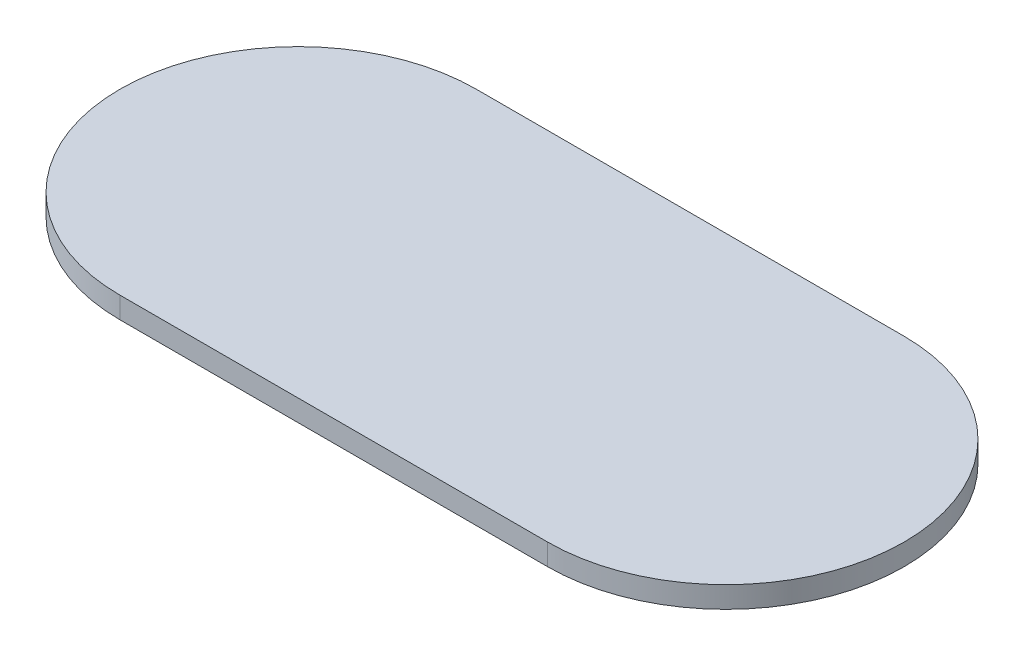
ISO-10303-21;
HEADER;
FILE_DESCRIPTION(('STEP AP214'),'2;1');
FILE_NAME('part.step','',(''),(''),'','','');
FILE_SCHEMA(('AUTOMOTIVE_DESIGN { 1 0 10303 214 1 1 1 1 }'));
ENDSEC;
DATA;
#1=APPLICATION_CONTEXT('core data for automotive mechanical design processes');
#2=APPLICATION_PROTOCOL_DEFINITION('international standard','automotive_design',2000,#1);
#3=PRODUCT_CONTEXT('',#1,'mechanical');
#4=PRODUCT('Part','Part','',(#3));
#5=PRODUCT_RELATED_PRODUCT_CATEGORY('part','',(#4));
#6=PRODUCT_DEFINITION_FORMATION('','',#4);
#7=PRODUCT_DEFINITION_CONTEXT('part definition',#1,'design');
#8=PRODUCT_DEFINITION('design','',#6,#7);
#9=PRODUCT_DEFINITION_SHAPE('','',#8);
#10=(LENGTH_UNIT() NAMED_UNIT(*) SI_UNIT(.MILLI.,.METRE.));
#11=(NAMED_UNIT(*) PLANE_ANGLE_UNIT() SI_UNIT($,.RADIAN.));
#12=(NAMED_UNIT(*) SI_UNIT($,.STERADIAN.) SOLID_ANGLE_UNIT());
#13=UNCERTAINTY_MEASURE_WITH_UNIT(LENGTH_MEASURE(1.E-05),#10,'distance_accuracy_value','');
#14=(GEOMETRIC_REPRESENTATION_CONTEXT(3) GLOBAL_UNCERTAINTY_ASSIGNED_CONTEXT((#13)) GLOBAL_UNIT_ASSIGNED_CONTEXT((#10,
#11,#12)) REPRESENTATION_CONTEXT('',''));
#15=CARTESIAN_POINT('',(0.,0.,0.));
#16=DIRECTION('',(0.,0.,1.));
#17=DIRECTION('',(1.,0.,0.));
#18=AXIS2_PLACEMENT_3D('',#15,#16,#17);
#19=CARTESIAN_POINT('',(-150.,7.5,0.));
#20=DIRECTION('',(0.,-1.,0.));
#21=DIRECTION('',(0.,0.,-1.));
#22=AXIS2_PLACEMENT_3D('',#19,#20,#21);
#23=CYLINDRICAL_SURFACE('',#22,125.);
#24=CARTESIAN_POINT('',(-150.,-7.5,0.));
#25=DIRECTION('',(0.,1.,0.));
#26=DIRECTION('',(0.,0.,1.));
#27=AXIS2_PLACEMENT_3D('',#24,#25,#26);
#28=CIRCLE('',#27,125.);
#29=CARTESIAN_POINT('',(-150.,-7.5,-125.));
#30=VERTEX_POINT('',#29);
#31=CARTESIAN_POINT('',(-150.,-7.5,125.));
#32=VERTEX_POINT('',#31);
#33=EDGE_CURVE('E97',#30,#32,#28,.T.);
#34=ORIENTED_EDGE('',*,*,#33,.T.);
#35=DIRECTION('',(0.,-1.,0.));
#36=VECTOR('',#35,1.);
#37=CARTESIAN_POINT('',(-150.,7.5,125.));
#38=LINE('',#37,#36);
#39=CARTESIAN_POINT('',(-150.,7.5,125.));
#40=VERTEX_POINT('',#39);
#41=EDGE_CURVE('E11',#40,#32,#38,.T.);
#42=ORIENTED_EDGE('',*,*,#41,.F.);
#43=CARTESIAN_POINT('',(-150.,7.5,0.));
#44=DIRECTION('',(0.,1.,0.));
#45=DIRECTION('',(0.,0.,1.));
#46=AXIS2_PLACEMENT_3D('',#43,#44,#45);
#47=CIRCLE('',#46,125.);
#48=CARTESIAN_POINT('',(-150.,7.5,-125.));
#49=VERTEX_POINT('',#48);
#50=EDGE_CURVE('E85',#49,#40,#47,.T.);
#51=ORIENTED_EDGE('',*,*,#50,.F.);
#52=DIRECTION('',(0.,-1.,0.));
#53=VECTOR('',#52,1.);
#54=CARTESIAN_POINT('',(-150.,7.5,-125.));
#55=LINE('',#54,#53);
#56=EDGE_CURVE('E93',#49,#30,#55,.T.);
#57=ORIENTED_EDGE('',*,*,#56,.T.);
#58=EDGE_LOOP('',(#34,#42,#51,#57));
#59=FACE_BOUND('',#58,.T.);
#60=ADVANCED_FACE('F34',(#59),#23,.T.);
#61=CARTESIAN_POINT('',(-150.,7.5,125.));
#62=DIRECTION('',(0.,0.,-1.));
#63=DIRECTION('',(-1.,0.,0.));
#64=AXIS2_PLACEMENT_3D('',#61,#62,#63);
#65=PLANE('',#64);
#66=DIRECTION('',(1.,0.,0.));
#67=VECTOR('',#66,1.);
#68=CARTESIAN_POINT('',(-150.,-7.5,125.));
#69=LINE('',#68,#67);
#70=CARTESIAN_POINT('',(150.,-7.5,125.));
#71=VERTEX_POINT('',#70);
#72=EDGE_CURVE('E89',#32,#71,#69,.T.);
#73=ORIENTED_EDGE('',*,*,#72,.T.);
#74=DIRECTION('',(0.,-1.,0.));
#75=VECTOR('',#74,1.);
#76=CARTESIAN_POINT('',(150.,7.5,125.));
#77=LINE('',#76,#75);
#78=CARTESIAN_POINT('',(150.,7.5,125.));
#79=VERTEX_POINT('',#78);
#80=EDGE_CURVE('E42',#79,#71,#77,.T.);
#81=ORIENTED_EDGE('',*,*,#80,.F.);
#82=DIRECTION('',(1.,0.,0.));
#83=VECTOR('',#82,1.);
#84=CARTESIAN_POINT('',(-150.,7.5,125.));
#85=LINE('',#84,#83);
#86=EDGE_CURVE('E80',#40,#79,#85,.T.);
#87=ORIENTED_EDGE('',*,*,#86,.F.);
#88=ORIENTED_EDGE('',*,*,#41,.T.);
#89=EDGE_LOOP('',(#73,#81,#87,#88));
#90=FACE_BOUND('',#89,.T.);
#91=ADVANCED_FACE('F88',(#90),#65,.F.);
#92=CARTESIAN_POINT('',(150.,7.5,0.));
#93=DIRECTION('',(0.,-1.,0.));
#94=DIRECTION('',(0.,0.,-1.));
#95=AXIS2_PLACEMENT_3D('',#92,#93,#94);
#96=CYLINDRICAL_SURFACE('',#95,125.);
#97=CARTESIAN_POINT('',(150.,-7.5,0.));
#98=DIRECTION('',(0.,1.,0.));
#99=DIRECTION('',(0.,0.,1.));
#100=AXIS2_PLACEMENT_3D('',#97,#98,#99);
#101=CIRCLE('',#100,125.);
#102=CARTESIAN_POINT('',(150.,-7.5,-125.));
#103=VERTEX_POINT('',#102);
#104=EDGE_CURVE('E67',#71,#103,#101,.T.);
#105=ORIENTED_EDGE('',*,*,#104,.T.);
#106=DIRECTION('',(0.,-1.,0.));
#107=VECTOR('',#106,1.);
#108=CARTESIAN_POINT('',(150.,7.5,-125.));
#109=LINE('',#108,#107);
#110=CARTESIAN_POINT('',(150.,7.5,-125.));
#111=VERTEX_POINT('',#110);
#112=EDGE_CURVE('E90',#111,#103,#109,.T.);
#113=ORIENTED_EDGE('',*,*,#112,.F.);
#114=CARTESIAN_POINT('',(150.,7.5,0.));
#115=DIRECTION('',(0.,1.,0.));
#116=DIRECTION('',(0.,0.,1.));
#117=AXIS2_PLACEMENT_3D('',#114,#115,#116);
#118=CIRCLE('',#117,125.);
#119=EDGE_CURVE('E83',#79,#111,#118,.T.);
#120=ORIENTED_EDGE('',*,*,#119,.F.);
#121=ORIENTED_EDGE('',*,*,#80,.T.);
#122=EDGE_LOOP('',(#105,#113,#120,#121));
#123=FACE_BOUND('',#122,.T.);
#124=ADVANCED_FACE('F91',(#123),#96,.T.);
#125=CARTESIAN_POINT('',(-150.,7.5,-125.));
#126=DIRECTION('',(0.,0.,1.));
#127=DIRECTION('',(1.,0.,0.));
#128=AXIS2_PLACEMENT_3D('',#125,#126,#127);
#129=PLANE('',#128);
#130=DIRECTION('',(-1.,0.,0.));
#131=VECTOR('',#130,1.);
#132=CARTESIAN_POINT('',(-150.,-7.5,-125.));
#133=LINE('',#132,#131);
#134=EDGE_CURVE('E73',#103,#30,#133,.T.);
#135=ORIENTED_EDGE('',*,*,#134,.T.);
#136=ORIENTED_EDGE('',*,*,#56,.F.);
#137=DIRECTION('',(-1.,0.,0.));
#138=VECTOR('',#137,1.);
#139=CARTESIAN_POINT('',(-150.,7.5,-125.));
#140=LINE('',#139,#138);
#141=EDGE_CURVE('E50',#111,#49,#140,.T.);
#142=ORIENTED_EDGE('',*,*,#141,.F.);
#143=ORIENTED_EDGE('',*,*,#112,.T.);
#144=EDGE_LOOP('',(#135,#136,#142,#143));
#145=FACE_BOUND('',#144,.T.);
#146=ADVANCED_FACE('F104',(#145),#129,.F.);
#147=CARTESIAN_POINT('',(-150.,7.5,0.));
#148=DIRECTION('',(0.,1.,0.));
#149=DIRECTION('',(0.,0.,1.));
#150=AXIS2_PLACEMENT_3D('',#147,#148,#149);
#151=PLANE('',#150);
#152=ORIENTED_EDGE('',*,*,#50,.T.);
#153=ORIENTED_EDGE('',*,*,#86,.T.);
#154=ORIENTED_EDGE('',*,*,#119,.T.);
#155=ORIENTED_EDGE('',*,*,#141,.T.);
#156=EDGE_LOOP('',(#152,#153,#154,#155));
#157=FACE_BOUND('',#156,.T.);
#158=ADVANCED_FACE('F81',(#157),#151,.T.);
#159=CARTESIAN_POINT('',(-150.,-7.5,0.));
#160=DIRECTION('',(0.,1.,0.));
#161=DIRECTION('',(0.,0.,1.));
#162=AXIS2_PLACEMENT_3D('',#159,#160,#161);
#163=PLANE('',#162);
#164=ORIENTED_EDGE('',*,*,#33,.F.);
#165=ORIENTED_EDGE('',*,*,#134,.F.);
#166=ORIENTED_EDGE('',*,*,#104,.F.);
#167=ORIENTED_EDGE('',*,*,#72,.F.);
#168=EDGE_LOOP('',(#164,#165,#166,#167));
#169=FACE_BOUND('',#168,.T.);
#170=ADVANCED_FACE('F107',(#169),#163,.F.);
#171=CLOSED_SHELL('',(#60,#91,#124,#146,#158,#170));
#172=MANIFOLD_SOLID_BREP('B2',#171);
#173=ADVANCED_BREP_SHAPE_REPRESENTATION('',(#18,#172),#14);
#174=SHAPE_DEFINITION_REPRESENTATION(#9,#173);
ENDSEC;
END-ISO-10303-21;
